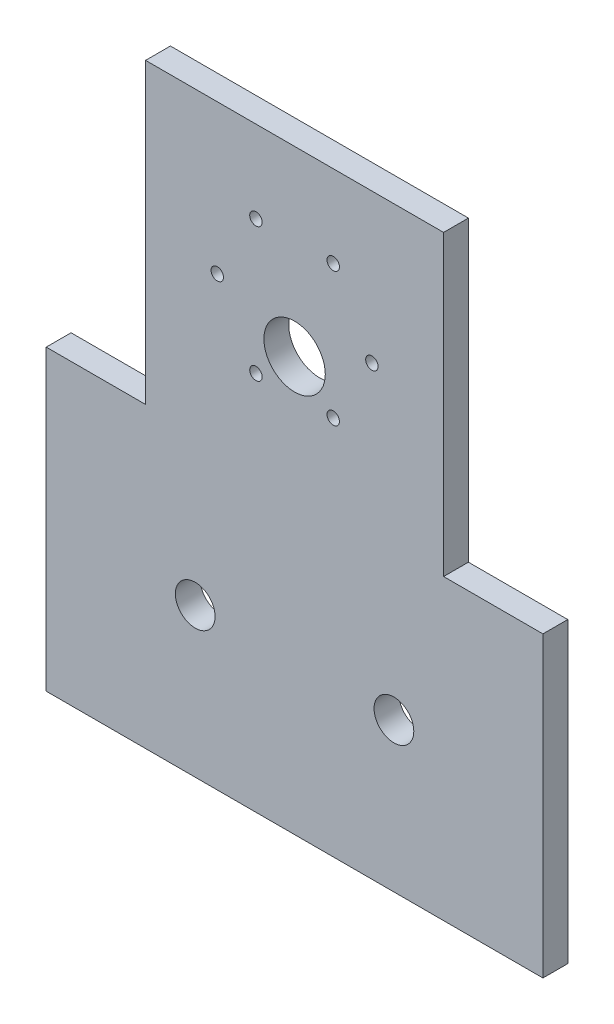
from build123d import *

# Parameters (mm, degrees)
SKETCH1_R           = 4
SKETCH1_R_2         = 1.25
SKETCH1_R_3         = 6.18
BOSS_EXTRUDE1_DEPTH = 5


with BuildPart() as part:
    # Sketch1 → Boss-Extrude1 (new body)
    with BuildSketch(Plane.XY):
        Polygon((0, 0), (100, 0), (100, 60), (80, 60), (80, 120), (20, 120), (20, 60), (0, 60), align=None)
        with Locations((30, 30)):
            Circle(SKETCH1_R, mode=Mode.SUBTRACT)
        with Locations((70, 30)):
            Circle(SKETCH1_R, mode=Mode.SUBTRACT)
        with Locations((65.56, 90)):
            Circle(SKETCH1_R_2, mode=Mode.SUBTRACT)
        with Locations((57.78, 76.524644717)):
            Circle(SKETCH1_R_2, mode=Mode.SUBTRACT)
        with Locations((42.22, 76.524644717)):
            Circle(SKETCH1_R_2, mode=Mode.SUBTRACT)
        with Locations((34.44, 90)):
            Circle(SKETCH1_R_2, mode=Mode.SUBTRACT)
        with Locations((42.22, 103.475355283)):
            Circle(SKETCH1_R_2, mode=Mode.SUBTRACT)
        with Locations((57.78, 103.475355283)):
            Circle(SKETCH1_R_2, mode=Mode.SUBTRACT)
        with Locations((50, 83.35)):
            Circle(SKETCH1_R_3, mode=Mode.SUBTRACT)
    extrude(amount=BOSS_EXTRUDE1_DEPTH)


solid = part.part
